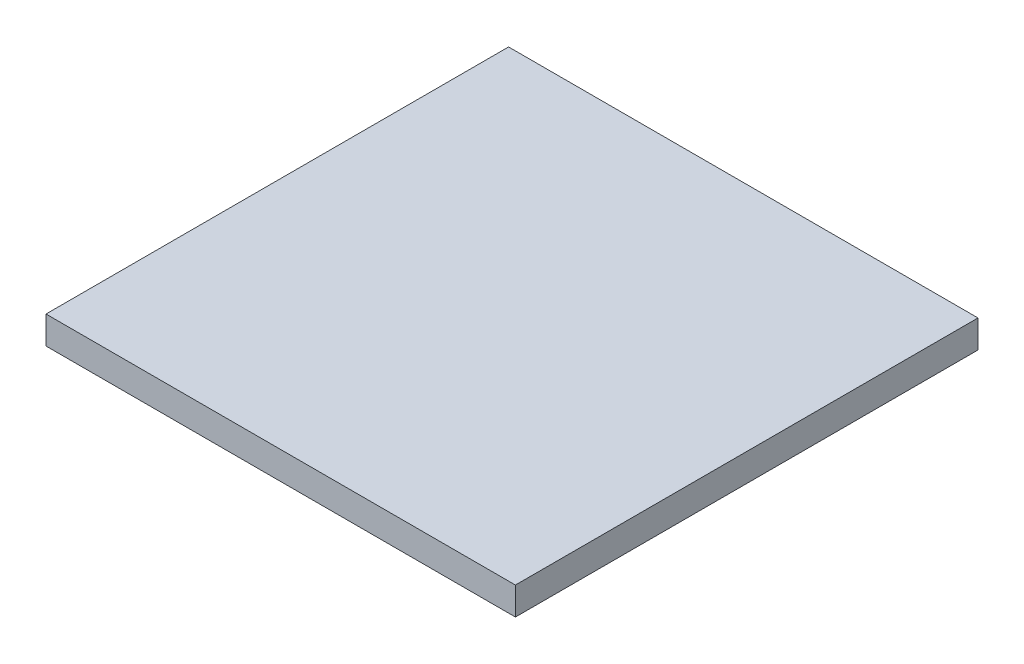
from build123d import *

# Parameters (mm, degrees)
SKETCH1_W           = 202.95
SKETCH1_H           = 200
BOSS_EXTRUDE1_DEPTH = 12


with BuildPart() as part:
    # Sketch1 → Boss-Extrude1 (new body)
    with BuildSketch(Plane(origin=(0, 0, 0), x_dir=(1, 0, 0), z_dir=(0, 1, 0))):
        Rectangle(SKETCH1_W, SKETCH1_H)
    extrude(amount=BOSS_EXTRUDE1_DEPTH)


solid = part.part
